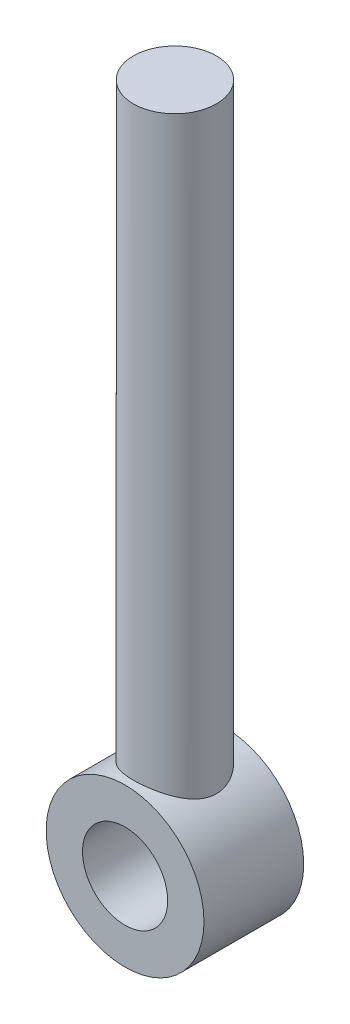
from build123d import *

# Parameters (mm, degrees)
SKETCH1_R           = 7.9375
EXTRUDE1_DEPTH      = 114.3
EXTRUDE2_DEPTH      = 9.525
EXTRUDE2_DEPTH_BACK = 9.525
SKETCH2_R           = 15.08125
SKETCH2_R_2         = 8.1359375


with BuildPart() as part:
    # Sketch1 → Extrude1 (new body)
    with BuildSketch(Plane(origin=(0, 0, 0), x_dir=(1, 0, 0), z_dir=(0, 1, 0))):
        with Locations(Location((0, 0, 0), (0, 0, 90))):
            Circle(SKETCH1_R)
    extrude(amount=EXTRUDE1_DEPTH)

    # Sketch2 → Extrude2 (add, two sides: drawn at the far end of the back side and taken through both)
    with BuildSketch(Plane.XY.offset(-EXTRUDE2_DEPTH_BACK)):
        with Locations((0, -12.7)):
            Circle(SKETCH2_R)
        with Locations((0, -12.7)):
            Circle(SKETCH2_R_2, mode=Mode.SUBTRACT)
    extrude(amount=EXTRUDE2_DEPTH + EXTRUDE2_DEPTH_BACK)


solid = part.part
